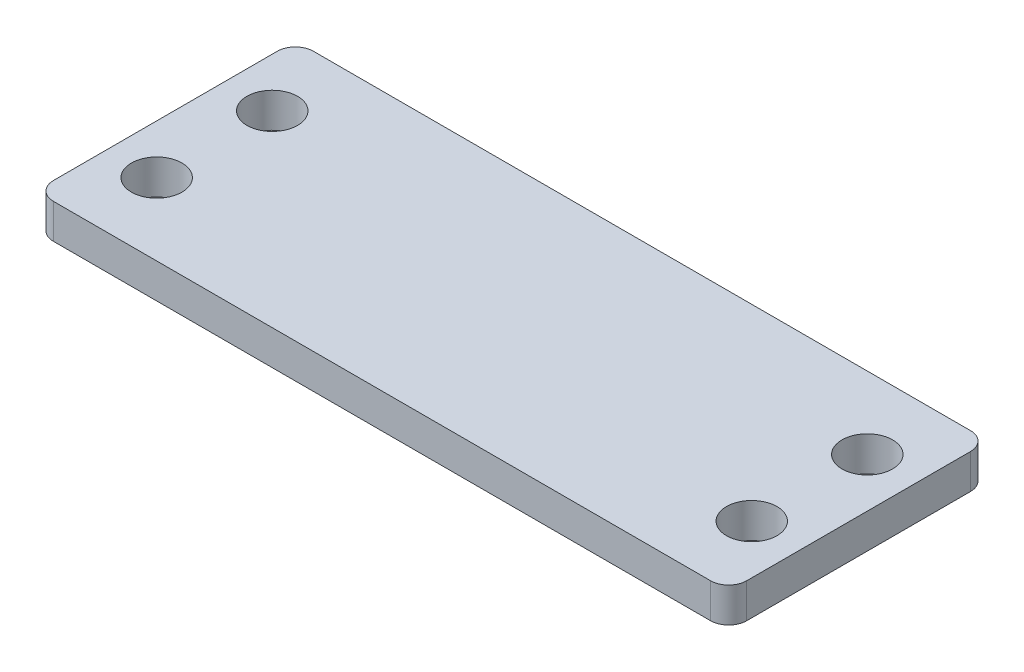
ISO-10303-21;
HEADER;
FILE_DESCRIPTION(('STEP AP214'),'2;1');
FILE_NAME('part.step','',(''),(''),'','','');
FILE_SCHEMA(('AUTOMOTIVE_DESIGN { 1 0 10303 214 1 1 1 1 }'));
ENDSEC;
DATA;
#1=APPLICATION_CONTEXT('core data for automotive mechanical design processes');
#2=APPLICATION_PROTOCOL_DEFINITION('international standard','automotive_design',2000,#1);
#3=PRODUCT_CONTEXT('',#1,'mechanical');
#4=PRODUCT('Part','Part','',(#3));
#5=PRODUCT_RELATED_PRODUCT_CATEGORY('part','',(#4));
#6=PRODUCT_DEFINITION_FORMATION('','',#4);
#7=PRODUCT_DEFINITION_CONTEXT('part definition',#1,'design');
#8=PRODUCT_DEFINITION('design','',#6,#7);
#9=PRODUCT_DEFINITION_SHAPE('','',#8);
#10=(LENGTH_UNIT() NAMED_UNIT(*) SI_UNIT(.MILLI.,.METRE.));
#11=(NAMED_UNIT(*) PLANE_ANGLE_UNIT() SI_UNIT($,.RADIAN.));
#12=(NAMED_UNIT(*) SI_UNIT($,.STERADIAN.) SOLID_ANGLE_UNIT());
#13=UNCERTAINTY_MEASURE_WITH_UNIT(LENGTH_MEASURE(1.E-05),#10,'distance_accuracy_value','');
#14=(GEOMETRIC_REPRESENTATION_CONTEXT(3) GLOBAL_UNCERTAINTY_ASSIGNED_CONTEXT((#13)) GLOBAL_UNIT_ASSIGNED_CONTEXT((#10,
#11,#12)) REPRESENTATION_CONTEXT('',''));
#15=CARTESIAN_POINT('',(0.,0.,0.));
#16=DIRECTION('',(0.,0.,1.));
#17=DIRECTION('',(1.,0.,0.));
#18=AXIS2_PLACEMENT_3D('',#15,#16,#17);
#19=CARTESIAN_POINT('',(-30.48,1.524,-11.43));
#20=DIRECTION('',(1.,0.,0.));
#21=DIRECTION('',(0.,0.,-1.));
#22=AXIS2_PLACEMENT_3D('',#19,#20,#21);
#23=PLANE('',#22);
#24=DIRECTION('',(0.,-1.,0.));
#25=VECTOR('',#24,1.);
#26=CARTESIAN_POINT('',(-30.48,1.524,9.8425));
#27=LINE('',#26,#25);
#28=CARTESIAN_POINT('',(-30.48,-1.524,9.8425));
#29=VERTEX_POINT('',#28);
#30=CARTESIAN_POINT('',(-30.48,1.524,9.8425));
#31=VERTEX_POINT('',#30);
#32=EDGE_CURVE('E113',#29,#31,#27,.F.);
#33=ORIENTED_EDGE('',*,*,#32,.T.);
#34=DIRECTION('',(0.,0.,-1.));
#35=VECTOR('',#34,1.);
#36=CARTESIAN_POINT('',(-30.48,1.524,11.43));
#37=LINE('',#36,#35);
#38=CARTESIAN_POINT('',(-30.48,1.524,-9.8425));
#39=VERTEX_POINT('',#38);
#40=EDGE_CURVE('E137',#31,#39,#37,.T.);
#41=ORIENTED_EDGE('',*,*,#40,.T.);
#42=DIRECTION('',(0.,-1.,0.));
#43=VECTOR('',#42,1.);
#44=CARTESIAN_POINT('',(-30.48,1.524,-9.8425));
#45=LINE('',#44,#43);
#46=CARTESIAN_POINT('',(-30.48,-1.524,-9.8425));
#47=VERTEX_POINT('',#46);
#48=EDGE_CURVE('E115',#39,#47,#45,.T.);
#49=ORIENTED_EDGE('',*,*,#48,.T.);
#50=DIRECTION('',(0.,0.,-1.));
#51=VECTOR('',#50,1.);
#52=CARTESIAN_POINT('',(-30.48,-1.524,11.43));
#53=LINE('',#52,#51);
#54=EDGE_CURVE('E128',#29,#47,#53,.T.);
#55=ORIENTED_EDGE('',*,*,#54,.F.);
#56=EDGE_LOOP('',(#33,#41,#49,#55));
#57=FACE_BOUND('',#56,.T.);
#58=ADVANCED_FACE('F32',(#57),#23,.F.);
#59=CARTESIAN_POINT('',(-30.48,1.524,11.43));
#60=DIRECTION('',(0.,0.,-1.));
#61=DIRECTION('',(-1.,0.,0.));
#62=AXIS2_PLACEMENT_3D('',#59,#60,#61);
#63=PLANE('',#62);
#64=DIRECTION('',(0.,-1.,0.));
#65=VECTOR('',#64,1.);
#66=CARTESIAN_POINT('',(28.8925,1.524,11.43));
#67=LINE('',#66,#65);
#68=CARTESIAN_POINT('',(28.8925,-1.524,11.43));
#69=VERTEX_POINT('',#68);
#70=CARTESIAN_POINT('',(28.8925,1.524,11.43));
#71=VERTEX_POINT('',#70);
#72=EDGE_CURVE('E96',#69,#71,#67,.F.);
#73=ORIENTED_EDGE('',*,*,#72,.T.);
#74=DIRECTION('',(1.,0.,0.));
#75=VECTOR('',#74,1.);
#76=CARTESIAN_POINT('',(-30.48,1.524,11.43));
#77=LINE('',#76,#75);
#78=CARTESIAN_POINT('',(-28.8925,1.524,11.43));
#79=VERTEX_POINT('',#78);
#80=EDGE_CURVE('E36',#79,#71,#77,.T.);
#81=ORIENTED_EDGE('',*,*,#80,.F.);
#82=DIRECTION('',(0.,-1.,0.));
#83=VECTOR('',#82,1.);
#84=CARTESIAN_POINT('',(-28.8925,1.524,11.43));
#85=LINE('',#84,#83);
#86=CARTESIAN_POINT('',(-28.8925,-1.524,11.43));
#87=VERTEX_POINT('',#86);
#88=EDGE_CURVE('E101',#79,#87,#85,.T.);
#89=ORIENTED_EDGE('',*,*,#88,.T.);
#90=DIRECTION('',(1.,0.,0.));
#91=VECTOR('',#90,1.);
#92=CARTESIAN_POINT('',(-30.48,-1.524,11.43));
#93=LINE('',#92,#91);
#94=EDGE_CURVE('E11',#87,#69,#93,.T.);
#95=ORIENTED_EDGE('',*,*,#94,.T.);
#96=EDGE_LOOP('',(#73,#81,#89,#95));
#97=FACE_BOUND('',#96,.T.);
#98=ADVANCED_FACE('F97',(#97),#63,.F.);
#99=CARTESIAN_POINT('',(30.48,1.524,-11.43));
#100=DIRECTION('',(-1.,0.,0.));
#101=DIRECTION('',(0.,0.,1.));
#102=AXIS2_PLACEMENT_3D('',#99,#100,#101);
#103=PLANE('',#102);
#104=DIRECTION('',(0.,-1.,0.));
#105=VECTOR('',#104,1.);
#106=CARTESIAN_POINT('',(30.48,1.524,-9.8425));
#107=LINE('',#106,#105);
#108=CARTESIAN_POINT('',(30.48,-1.524,-9.8425));
#109=VERTEX_POINT('',#108);
#110=CARTESIAN_POINT('',(30.48,1.524,-9.8425));
#111=VERTEX_POINT('',#110);
#112=EDGE_CURVE('E157',#109,#111,#107,.F.);
#113=ORIENTED_EDGE('',*,*,#112,.T.);
#114=DIRECTION('',(0.,0.,-1.));
#115=VECTOR('',#114,1.);
#116=CARTESIAN_POINT('',(30.48,1.524,-11.43));
#117=LINE('',#116,#115);
#118=CARTESIAN_POINT('',(30.48,1.524,9.8425));
#119=VERTEX_POINT('',#118);
#120=EDGE_CURVE('E108',#119,#111,#117,.T.);
#121=ORIENTED_EDGE('',*,*,#120,.F.);
#122=DIRECTION('',(0.,-1.,0.));
#123=VECTOR('',#122,1.);
#124=CARTESIAN_POINT('',(30.48,1.524,9.8425));
#125=LINE('',#124,#123);
#126=CARTESIAN_POINT('',(30.48,-1.524,9.8425));
#127=VERTEX_POINT('',#126);
#128=EDGE_CURVE('E90',#119,#127,#125,.T.);
#129=ORIENTED_EDGE('',*,*,#128,.T.);
#130=DIRECTION('',(0.,0.,-1.));
#131=VECTOR('',#130,1.);
#132=CARTESIAN_POINT('',(30.48,-1.524,-11.43));
#133=LINE('',#132,#131);
#134=EDGE_CURVE('E138',#127,#109,#133,.T.);
#135=ORIENTED_EDGE('',*,*,#134,.T.);
#136=EDGE_LOOP('',(#113,#121,#129,#135));
#137=FACE_BOUND('',#136,.T.);
#138=ADVANCED_FACE('F155',(#137),#103,.F.);
#139=CARTESIAN_POINT('',(-30.48,1.524,-11.43));
#140=DIRECTION('',(0.,0.,1.));
#141=DIRECTION('',(1.,0.,0.));
#142=AXIS2_PLACEMENT_3D('',#139,#140,#141);
#143=PLANE('',#142);
#144=DIRECTION('',(0.,-1.,0.));
#145=VECTOR('',#144,1.);
#146=CARTESIAN_POINT('',(-28.8925,1.524,-11.43));
#147=LINE('',#146,#145);
#148=CARTESIAN_POINT('',(-28.8925,-1.524,-11.43));
#149=VERTEX_POINT('',#148);
#150=CARTESIAN_POINT('',(-28.8925,1.524,-11.43));
#151=VERTEX_POINT('',#150);
#152=EDGE_CURVE('E100',#149,#151,#147,.F.);
#153=ORIENTED_EDGE('',*,*,#152,.T.);
#154=DIRECTION('',(-1.,0.,0.));
#155=VECTOR('',#154,1.);
#156=CARTESIAN_POINT('',(-30.48,1.524,-11.43));
#157=LINE('',#156,#155);
#158=CARTESIAN_POINT('',(28.8925,1.524,-11.43));
#159=VERTEX_POINT('',#158);
#160=EDGE_CURVE('E133',#159,#151,#157,.T.);
#161=ORIENTED_EDGE('',*,*,#160,.F.);
#162=DIRECTION('',(0.,-1.,0.));
#163=VECTOR('',#162,1.);
#164=CARTESIAN_POINT('',(28.8925,1.524,-11.43));
#165=LINE('',#164,#163);
#166=CARTESIAN_POINT('',(28.8925,-1.524,-11.43));
#167=VERTEX_POINT('',#166);
#168=EDGE_CURVE('E120',#159,#167,#165,.T.);
#169=ORIENTED_EDGE('',*,*,#168,.T.);
#170=DIRECTION('',(-1.,0.,0.));
#171=VECTOR('',#170,1.);
#172=CARTESIAN_POINT('',(-30.48,-1.524,-11.43));
#173=LINE('',#172,#171);
#174=EDGE_CURVE('E129',#167,#149,#173,.T.);
#175=ORIENTED_EDGE('',*,*,#174,.T.);
#176=EDGE_LOOP('',(#153,#161,#169,#175));
#177=FACE_BOUND('',#176,.T.);
#178=ADVANCED_FACE('F167',(#177),#143,.F.);
#179=CARTESIAN_POINT('',(-30.48,1.524,11.43));
#180=DIRECTION('',(0.,1.,0.));
#181=DIRECTION('',(0.,0.,1.));
#182=AXIS2_PLACEMENT_3D('',#179,#180,#181);
#183=PLANE('',#182);
#184=CARTESIAN_POINT('',(28.8925,1.524,-9.8425));
#185=DIRECTION('',(0.,1.,0.));
#186=DIRECTION('',(0.,0.,1.));
#187=AXIS2_PLACEMENT_3D('',#184,#185,#186);
#188=CIRCLE('',#187,1.5875);
#189=EDGE_CURVE('E151',#111,#159,#188,.T.);
#190=ORIENTED_EDGE('',*,*,#189,.T.);
#191=ORIENTED_EDGE('',*,*,#160,.T.);
#192=CARTESIAN_POINT('',(-28.8925,1.524,-9.8425));
#193=DIRECTION('',(0.,1.,0.));
#194=DIRECTION('',(0.,0.,1.));
#195=AXIS2_PLACEMENT_3D('',#192,#193,#194);
#196=CIRCLE('',#195,1.5875);
#197=EDGE_CURVE('E127',#39,#151,#196,.F.);
#198=ORIENTED_EDGE('',*,*,#197,.F.);
#199=ORIENTED_EDGE('',*,*,#40,.F.);
#200=CARTESIAN_POINT('',(-28.8925,1.524,9.8425));
#201=DIRECTION('',(0.,1.,0.));
#202=DIRECTION('',(0.,0.,1.));
#203=AXIS2_PLACEMENT_3D('',#200,#201,#202);
#204=CIRCLE('',#203,1.5875);
#205=EDGE_CURVE('E112',#79,#31,#204,.F.);
#206=ORIENTED_EDGE('',*,*,#205,.F.);
#207=ORIENTED_EDGE('',*,*,#80,.T.);
#208=CARTESIAN_POINT('',(28.8925,1.524,9.8425));
#209=DIRECTION('',(0.,1.,0.));
#210=DIRECTION('',(0.,0.,1.));
#211=AXIS2_PLACEMENT_3D('',#208,#209,#210);
#212=CIRCLE('',#211,1.5875);
#213=EDGE_CURVE('E104',#71,#119,#212,.T.);
#214=ORIENTED_EDGE('',*,*,#213,.T.);
#215=ORIENTED_EDGE('',*,*,#120,.T.);
#216=EDGE_LOOP('',(#190,#191,#198,#199,#206,#207,#214,#215));
#217=FACE_BOUND('',#216,.T.);
#218=CARTESIAN_POINT('',(-26.162,1.524,5.08));
#219=DIRECTION('',(0.,1.,0.));
#220=DIRECTION('',(0.,0.,-1.));
#221=AXIS2_PLACEMENT_3D('',#218,#219,#220);
#222=CIRCLE('',#221,2.2225);
#223=CARTESIAN_POINT('',(-26.162,1.524,2.8575));
#224=VERTEX_POINT('',#223);
#225=EDGE_CURVE('E199',#224,#224,#222,.T.);
#226=ORIENTED_EDGE('',*,*,#225,.F.);
#227=EDGE_LOOP('',(#226));
#228=FACE_BOUND('',#227,.T.);
#229=CARTESIAN_POINT('',(26.162,1.524,-5.08));
#230=DIRECTION('',(0.,1.,0.));
#231=DIRECTION('',(0.,0.,-1.));
#232=AXIS2_PLACEMENT_3D('',#229,#230,#231);
#233=CIRCLE('',#232,2.2225);
#234=CARTESIAN_POINT('',(26.162,1.524,-7.3025));
#235=VERTEX_POINT('',#234);
#236=EDGE_CURVE('E193',#235,#235,#233,.T.);
#237=ORIENTED_EDGE('',*,*,#236,.F.);
#238=EDGE_LOOP('',(#237));
#239=FACE_BOUND('',#238,.T.);
#240=CARTESIAN_POINT('',(-26.162,1.524,-5.08));
#241=DIRECTION('',(0.,1.,0.));
#242=DIRECTION('',(0.,0.,1.));
#243=AXIS2_PLACEMENT_3D('',#240,#241,#242);
#244=CIRCLE('',#243,2.2225);
#245=CARTESIAN_POINT('',(-26.162,1.524,-2.8575));
#246=VERTEX_POINT('',#245);
#247=EDGE_CURVE('E187',#246,#246,#244,.T.);
#248=ORIENTED_EDGE('',*,*,#247,.F.);
#249=EDGE_LOOP('',(#248));
#250=FACE_BOUND('',#249,.T.);
#251=CARTESIAN_POINT('',(26.162,1.524,5.08));
#252=DIRECTION('',(0.,1.,0.));
#253=DIRECTION('',(0.,0.,1.));
#254=AXIS2_PLACEMENT_3D('',#251,#252,#253);
#255=CIRCLE('',#254,2.2225);
#256=CARTESIAN_POINT('',(26.162,1.524,7.3025));
#257=VERTEX_POINT('',#256);
#258=EDGE_CURVE('E181',#257,#257,#255,.T.);
#259=ORIENTED_EDGE('',*,*,#258,.F.);
#260=EDGE_LOOP('',(#259));
#261=FACE_BOUND('',#260,.T.);
#262=ADVANCED_FACE('F34',(#217,#228,#239,#250,#261),#183,.T.);
#263=CARTESIAN_POINT('',(-30.48,-1.524,11.43));
#264=DIRECTION('',(0.,1.,0.));
#265=DIRECTION('',(0.,0.,1.));
#266=AXIS2_PLACEMENT_3D('',#263,#264,#265);
#267=PLANE('',#266);
#268=CARTESIAN_POINT('',(-28.8925,-1.524,-9.8425));
#269=DIRECTION('',(0.,1.,0.));
#270=DIRECTION('',(0.,0.,1.));
#271=AXIS2_PLACEMENT_3D('',#268,#269,#270);
#272=CIRCLE('',#271,1.5875);
#273=EDGE_CURVE('E124',#47,#149,#272,.F.);
#274=ORIENTED_EDGE('',*,*,#273,.T.);
#275=ORIENTED_EDGE('',*,*,#174,.F.);
#276=CARTESIAN_POINT('',(28.8925,-1.524,-9.8425));
#277=DIRECTION('',(0.,1.,0.));
#278=DIRECTION('',(0.,0.,1.));
#279=AXIS2_PLACEMENT_3D('',#276,#277,#278);
#280=CIRCLE('',#279,1.5875);
#281=EDGE_CURVE('E134',#109,#167,#280,.T.);
#282=ORIENTED_EDGE('',*,*,#281,.F.);
#283=ORIENTED_EDGE('',*,*,#134,.F.);
#284=CARTESIAN_POINT('',(28.8925,-1.524,9.8425));
#285=DIRECTION('',(0.,1.,0.));
#286=DIRECTION('',(0.,0.,1.));
#287=AXIS2_PLACEMENT_3D('',#284,#285,#286);
#288=CIRCLE('',#287,1.5875);
#289=EDGE_CURVE('E42',#69,#127,#288,.T.);
#290=ORIENTED_EDGE('',*,*,#289,.F.);
#291=ORIENTED_EDGE('',*,*,#94,.F.);
#292=CARTESIAN_POINT('',(-28.8925,-1.524,9.8425));
#293=DIRECTION('',(0.,1.,0.));
#294=DIRECTION('',(0.,0.,1.));
#295=AXIS2_PLACEMENT_3D('',#292,#293,#294);
#296=CIRCLE('',#295,1.5875);
#297=EDGE_CURVE('E132',#87,#29,#296,.F.);
#298=ORIENTED_EDGE('',*,*,#297,.T.);
#299=ORIENTED_EDGE('',*,*,#54,.T.);
#300=EDGE_LOOP('',(#274,#275,#282,#283,#290,#291,#298,#299));
#301=FACE_BOUND('',#300,.T.);
#302=CARTESIAN_POINT('',(-26.162,-1.524,5.08));
#303=DIRECTION('',(0.,1.,0.));
#304=DIRECTION('',(0.,0.,-1.));
#305=AXIS2_PLACEMENT_3D('',#302,#303,#304);
#306=CIRCLE('',#305,2.2225);
#307=CARTESIAN_POINT('',(-26.162,-1.524,2.8575));
#308=VERTEX_POINT('',#307);
#309=EDGE_CURVE('E196',#308,#308,#306,.T.);
#310=ORIENTED_EDGE('',*,*,#309,.T.);
#311=EDGE_LOOP('',(#310));
#312=FACE_BOUND('',#311,.T.);
#313=CARTESIAN_POINT('',(26.162,-1.524,-5.08));
#314=DIRECTION('',(0.,1.,0.));
#315=DIRECTION('',(0.,0.,-1.));
#316=AXIS2_PLACEMENT_3D('',#313,#314,#315);
#317=CIRCLE('',#316,2.2225);
#318=CARTESIAN_POINT('',(26.162,-1.524,-7.3025));
#319=VERTEX_POINT('',#318);
#320=EDGE_CURVE('E190',#319,#319,#317,.T.);
#321=ORIENTED_EDGE('',*,*,#320,.T.);
#322=EDGE_LOOP('',(#321));
#323=FACE_BOUND('',#322,.T.);
#324=CARTESIAN_POINT('',(-26.162,-1.524,-5.08));
#325=DIRECTION('',(0.,1.,0.));
#326=DIRECTION('',(0.,0.,1.));
#327=AXIS2_PLACEMENT_3D('',#324,#325,#326);
#328=CIRCLE('',#327,2.2225);
#329=CARTESIAN_POINT('',(-26.162,-1.524,-2.8575));
#330=VERTEX_POINT('',#329);
#331=EDGE_CURVE('E184',#330,#330,#328,.T.);
#332=ORIENTED_EDGE('',*,*,#331,.T.);
#333=EDGE_LOOP('',(#332));
#334=FACE_BOUND('',#333,.T.);
#335=CARTESIAN_POINT('',(26.162,-1.524,5.08));
#336=DIRECTION('',(0.,1.,0.));
#337=DIRECTION('',(0.,0.,1.));
#338=AXIS2_PLACEMENT_3D('',#335,#336,#337);
#339=CIRCLE('',#338,2.2225);
#340=CARTESIAN_POINT('',(26.162,-1.524,7.3025));
#341=VERTEX_POINT('',#340);
#342=EDGE_CURVE('E159',#341,#341,#339,.T.);
#343=ORIENTED_EDGE('',*,*,#342,.T.);
#344=EDGE_LOOP('',(#343));
#345=FACE_BOUND('',#344,.T.);
#346=ADVANCED_FACE('F206',(#301,#312,#323,#334,#345),#267,.F.);
#347=CARTESIAN_POINT('',(26.162,-1.524,5.08));
#348=DIRECTION('',(0.,1.,0.));
#349=DIRECTION('',(0.,0.,1.));
#350=AXIS2_PLACEMENT_3D('',#347,#348,#349);
#351=CYLINDRICAL_SURFACE('',#350,2.2225);
#352=ORIENTED_EDGE('',*,*,#342,.F.);
#353=EDGE_LOOP('',(#352));
#354=FACE_BOUND('',#353,.T.);
#355=ORIENTED_EDGE('',*,*,#258,.T.);
#356=EDGE_LOOP('',(#355));
#357=FACE_BOUND('',#356,.T.);
#358=ADVANCED_FACE('F213',(#354,#357),#351,.F.);
#359=CARTESIAN_POINT('',(-26.162,-1.524,-5.08));
#360=DIRECTION('',(0.,1.,0.));
#361=DIRECTION('',(0.,0.,1.));
#362=AXIS2_PLACEMENT_3D('',#359,#360,#361);
#363=CYLINDRICAL_SURFACE('',#362,2.2225);
#364=ORIENTED_EDGE('',*,*,#331,.F.);
#365=EDGE_LOOP('',(#364));
#366=FACE_BOUND('',#365,.T.);
#367=ORIENTED_EDGE('',*,*,#247,.T.);
#368=EDGE_LOOP('',(#367));
#369=FACE_BOUND('',#368,.T.);
#370=ADVANCED_FACE('F215',(#366,#369),#363,.F.);
#371=CARTESIAN_POINT('',(26.162,-1.524,-5.08));
#372=DIRECTION('',(0.,1.,0.));
#373=DIRECTION('',(0.,0.,1.));
#374=AXIS2_PLACEMENT_3D('',#371,#372,#373);
#375=CYLINDRICAL_SURFACE('',#374,2.2225);
#376=ORIENTED_EDGE('',*,*,#320,.F.);
#377=EDGE_LOOP('',(#376));
#378=FACE_BOUND('',#377,.T.);
#379=ORIENTED_EDGE('',*,*,#236,.T.);
#380=EDGE_LOOP('',(#379));
#381=FACE_BOUND('',#380,.T.);
#382=ADVANCED_FACE('F222',(#378,#381),#375,.F.);
#383=CARTESIAN_POINT('',(-26.162,-1.524,5.08));
#384=DIRECTION('',(0.,1.,0.));
#385=DIRECTION('',(0.,0.,1.));
#386=AXIS2_PLACEMENT_3D('',#383,#384,#385);
#387=CYLINDRICAL_SURFACE('',#386,2.2225);
#388=ORIENTED_EDGE('',*,*,#309,.F.);
#389=EDGE_LOOP('',(#388));
#390=FACE_BOUND('',#389,.T.);
#391=ORIENTED_EDGE('',*,*,#225,.T.);
#392=EDGE_LOOP('',(#391));
#393=FACE_BOUND('',#392,.T.);
#394=ADVANCED_FACE('F203',(#390,#393),#387,.F.);
#395=CARTESIAN_POINT('',(28.8925,1.524,9.8425));
#396=DIRECTION('',(0.,-1.,0.));
#397=DIRECTION('',(0.,0.,-1.));
#398=AXIS2_PLACEMENT_3D('',#395,#396,#397);
#399=CYLINDRICAL_SURFACE('',#398,1.5875);
#400=ORIENTED_EDGE('',*,*,#128,.F.);
#401=ORIENTED_EDGE('',*,*,#213,.F.);
#402=ORIENTED_EDGE('',*,*,#72,.F.);
#403=ORIENTED_EDGE('',*,*,#289,.T.);
#404=EDGE_LOOP('',(#400,#401,#402,#403));
#405=FACE_BOUND('',#404,.T.);
#406=ADVANCED_FACE('F105',(#405),#399,.T.);
#407=CARTESIAN_POINT('',(28.8925,1.524,-9.8425));
#408=DIRECTION('',(0.,-1.,0.));
#409=DIRECTION('',(0.,0.,-1.));
#410=AXIS2_PLACEMENT_3D('',#407,#408,#409);
#411=CYLINDRICAL_SURFACE('',#410,1.5875);
#412=ORIENTED_EDGE('',*,*,#168,.F.);
#413=ORIENTED_EDGE('',*,*,#189,.F.);
#414=ORIENTED_EDGE('',*,*,#112,.F.);
#415=ORIENTED_EDGE('',*,*,#281,.T.);
#416=EDGE_LOOP('',(#412,#413,#414,#415));
#417=FACE_BOUND('',#416,.T.);
#418=ADVANCED_FACE('F161',(#417),#411,.T.);
#419=CARTESIAN_POINT('',(-28.8925,1.524,9.8425));
#420=DIRECTION('',(0.,-1.,0.));
#421=DIRECTION('',(0.,0.,-1.));
#422=AXIS2_PLACEMENT_3D('',#419,#420,#421);
#423=CYLINDRICAL_SURFACE('',#422,1.5875);
#424=ORIENTED_EDGE('',*,*,#88,.F.);
#425=ORIENTED_EDGE('',*,*,#205,.T.);
#426=ORIENTED_EDGE('',*,*,#32,.F.);
#427=ORIENTED_EDGE('',*,*,#297,.F.);
#428=EDGE_LOOP('',(#424,#425,#426,#427));
#429=FACE_BOUND('',#428,.T.);
#430=ADVANCED_FACE('F173',(#429),#423,.T.);
#431=CARTESIAN_POINT('',(-28.8925,1.524,-9.8425));
#432=DIRECTION('',(0.,-1.,0.));
#433=DIRECTION('',(0.,0.,-1.));
#434=AXIS2_PLACEMENT_3D('',#431,#432,#433);
#435=CYLINDRICAL_SURFACE('',#434,1.5875);
#436=ORIENTED_EDGE('',*,*,#48,.F.);
#437=ORIENTED_EDGE('',*,*,#197,.T.);
#438=ORIENTED_EDGE('',*,*,#152,.F.);
#439=ORIENTED_EDGE('',*,*,#273,.F.);
#440=EDGE_LOOP('',(#436,#437,#438,#439));
#441=FACE_BOUND('',#440,.T.);
#442=ADVANCED_FACE('F170',(#441),#435,.T.);
#443=CLOSED_SHELL('',(#58,#98,#138,#178,#262,#346,#358,#370,#382,#394,#406,#418,#430,#442));
#444=MANIFOLD_SOLID_BREP('B2',#443);
#445=ADVANCED_BREP_SHAPE_REPRESENTATION('',(#18,#444),#14);
#446=SHAPE_DEFINITION_REPRESENTATION(#9,#445);
ENDSEC;
END-ISO-10303-21;
